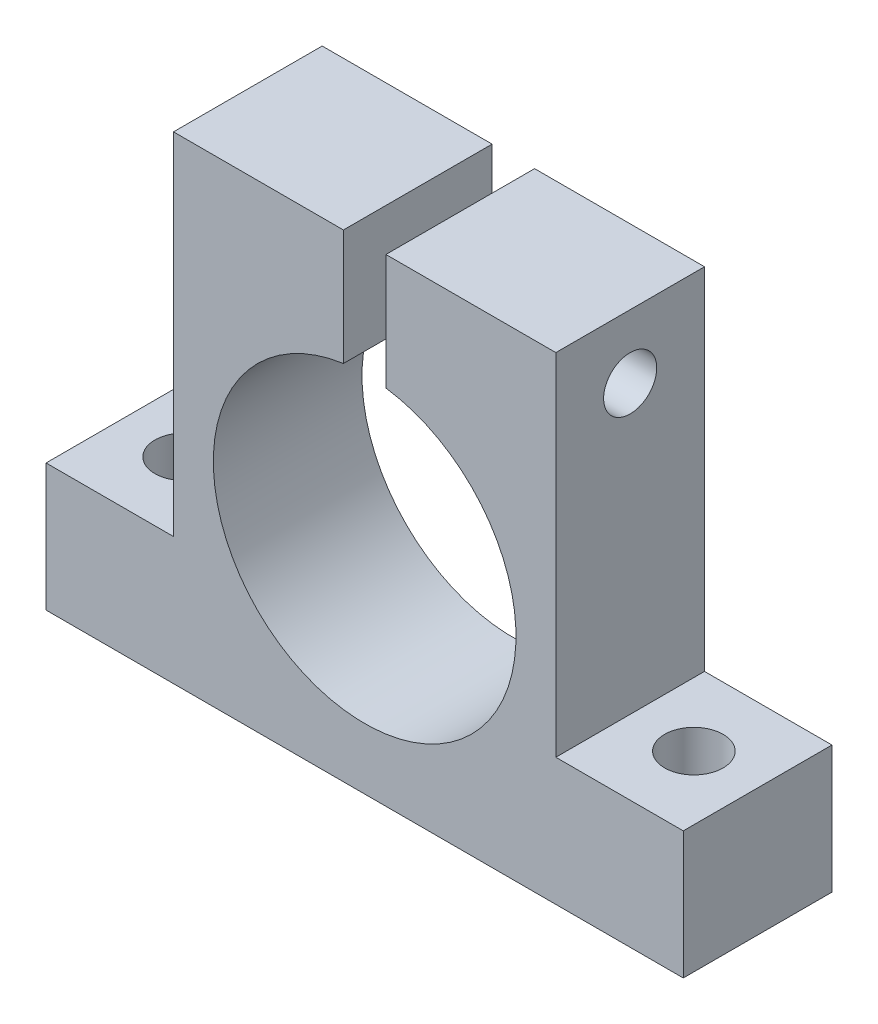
ISO-10303-21;
HEADER;
FILE_DESCRIPTION(('STEP AP214'),'2;1');
FILE_NAME('part.step','',(''),(''),'','','');
FILE_SCHEMA(('AUTOMOTIVE_DESIGN { 1 0 10303 214 1 1 1 1 }'));
ENDSEC;
DATA;
#1=APPLICATION_CONTEXT('core data for automotive mechanical design processes');
#2=APPLICATION_PROTOCOL_DEFINITION('international standard','automotive_design',2000,#1);
#3=PRODUCT_CONTEXT('',#1,'mechanical');
#4=PRODUCT('Part','Part','',(#3));
#5=PRODUCT_RELATED_PRODUCT_CATEGORY('part','',(#4));
#6=PRODUCT_DEFINITION_FORMATION('','',#4);
#7=PRODUCT_DEFINITION_CONTEXT('part definition',#1,'design');
#8=PRODUCT_DEFINITION('design','',#6,#7);
#9=PRODUCT_DEFINITION_SHAPE('','',#8);
#10=(LENGTH_UNIT() NAMED_UNIT(*) SI_UNIT(.MILLI.,.METRE.));
#11=(NAMED_UNIT(*) PLANE_ANGLE_UNIT() SI_UNIT($,.RADIAN.));
#12=(NAMED_UNIT(*) SI_UNIT($,.STERADIAN.) SOLID_ANGLE_UNIT());
#13=UNCERTAINTY_MEASURE_WITH_UNIT(LENGTH_MEASURE(1.E-05),#10,'distance_accuracy_value','');
#14=(GEOMETRIC_REPRESENTATION_CONTEXT(3) GLOBAL_UNCERTAINTY_ASSIGNED_CONTEXT((#13)) GLOBAL_UNIT_ASSIGNED_CONTEXT((#10,
#11,#12)) REPRESENTATION_CONTEXT('',''));
#15=CARTESIAN_POINT('',(0.,0.,0.));
#16=DIRECTION('',(0.,0.,1.));
#17=DIRECTION('',(1.,0.,0.));
#18=AXIS2_PLACEMENT_3D('',#15,#16,#17);
#19=CARTESIAN_POINT('',(-24.,-22.5,7.));
#20=DIRECTION('',(0.,1.,0.));
#21=DIRECTION('',(0.,0.,1.));
#22=AXIS2_PLACEMENT_3D('',#19,#20,#21);
#23=CYLINDRICAL_SURFACE('',#22,2.75);
#24=CARTESIAN_POINT('',(-24.,-22.5,7.));
#25=DIRECTION('',(0.,1.,0.));
#26=DIRECTION('',(0.,0.,1.));
#27=AXIS2_PLACEMENT_3D('',#24,#25,#26);
#28=CIRCLE('',#27,2.75);
#29=CARTESIAN_POINT('',(-24.,-22.5,9.75));
#30=VERTEX_POINT('',#29);
#31=EDGE_CURVE('E187',#30,#30,#28,.F.);
#32=ORIENTED_EDGE('',*,*,#31,.T.);
#33=EDGE_LOOP('',(#32));
#34=FACE_BOUND('',#33,.T.);
#35=CARTESIAN_POINT('',(-24.,-10.5,7.));
#36=DIRECTION('',(0.,1.,0.));
#37=DIRECTION('',(0.,0.,1.));
#38=AXIS2_PLACEMENT_3D('',#35,#36,#37);
#39=CIRCLE('',#38,2.75);
#40=CARTESIAN_POINT('',(-24.,-10.5,9.75));
#41=VERTEX_POINT('',#40);
#42=EDGE_CURVE('E223',#41,#41,#39,.T.);
#43=ORIENTED_EDGE('',*,*,#42,.T.);
#44=EDGE_LOOP('',(#43));
#45=FACE_BOUND('',#44,.T.);
#46=ADVANCED_FACE('F17',(#34,#45),#23,.F.);
#47=CARTESIAN_POINT('',(24.,-22.5,7.));
#48=DIRECTION('',(0.,1.,0.));
#49=DIRECTION('',(0.,0.,1.));
#50=AXIS2_PLACEMENT_3D('',#47,#48,#49);
#51=CYLINDRICAL_SURFACE('',#50,2.75);
#52=CARTESIAN_POINT('',(24.,-22.5,7.));
#53=DIRECTION('',(0.,1.,0.));
#54=DIRECTION('',(0.,0.,1.));
#55=AXIS2_PLACEMENT_3D('',#52,#53,#54);
#56=CIRCLE('',#55,2.75);
#57=CARTESIAN_POINT('',(24.,-22.5,9.75));
#58=VERTEX_POINT('',#57);
#59=EDGE_CURVE('E197',#58,#58,#56,.F.);
#60=ORIENTED_EDGE('',*,*,#59,.T.);
#61=EDGE_LOOP('',(#60));
#62=FACE_BOUND('',#61,.T.);
#63=CARTESIAN_POINT('',(24.,-10.5,7.));
#64=DIRECTION('',(0.,1.,0.));
#65=DIRECTION('',(0.,0.,1.));
#66=AXIS2_PLACEMENT_3D('',#63,#64,#65);
#67=CIRCLE('',#66,2.75);
#68=CARTESIAN_POINT('',(24.,-10.5,9.75));
#69=VERTEX_POINT('',#68);
#70=EDGE_CURVE('E242',#69,#69,#67,.T.);
#71=ORIENTED_EDGE('',*,*,#70,.T.);
#72=EDGE_LOOP('',(#71));
#73=FACE_BOUND('',#72,.T.);
#74=ADVANCED_FACE('F339',(#62,#73),#51,.F.);
#75=CARTESIAN_POINT('',(-5.07106781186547,16.5,7.));
#76=DIRECTION('',(1.,0.,0.));
#77=DIRECTION('',(0.,1.,0.));
#78=AXIS2_PLACEMENT_3D('',#75,#76,#77);
#79=CYLINDRICAL_SURFACE('',#78,2.5);
#80=CARTESIAN_POINT('',(18.,16.5,7.));
#81=DIRECTION('',(1.,0.,0.));
#82=DIRECTION('',(0.,1.,0.));
#83=AXIS2_PLACEMENT_3D('',#80,#81,#82);
#84=CIRCLE('',#83,2.5);
#85=CARTESIAN_POINT('',(18.,19.,7.));
#86=VERTEX_POINT('',#85);
#87=EDGE_CURVE('E165',#86,#86,#84,.T.);
#88=ORIENTED_EDGE('',*,*,#87,.T.);
#89=EDGE_LOOP('',(#88));
#90=FACE_BOUND('',#89,.T.);
#91=CARTESIAN_POINT('',(2.,16.5,7.));
#92=DIRECTION('',(1.,0.,0.));
#93=DIRECTION('',(0.,1.,0.));
#94=AXIS2_PLACEMENT_3D('',#91,#92,#93);
#95=CIRCLE('',#94,2.5);
#96=CARTESIAN_POINT('',(2.,19.,7.));
#97=VERTEX_POINT('',#96);
#98=EDGE_CURVE('E123',#97,#97,#95,.F.);
#99=ORIENTED_EDGE('',*,*,#98,.T.);
#100=EDGE_LOOP('',(#99));
#101=FACE_BOUND('',#100,.T.);
#102=ADVANCED_FACE('F342',(#90,#101),#79,.F.);
#103=CARTESIAN_POINT('',(-2.,16.5,7.));
#104=DIRECTION('',(1.,0.,0.));
#105=DIRECTION('',(0.,0.,-1.));
#106=AXIS2_PLACEMENT_3D('',#103,#104,#105);
#107=CYLINDRICAL_SURFACE('',#106,1.64999999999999);
#108=CARTESIAN_POINT('',(-18.,16.5,7.));
#109=DIRECTION('',(1.,0.,0.));
#110=DIRECTION('',(0.,0.,-1.));
#111=AXIS2_PLACEMENT_3D('',#108,#109,#110);
#112=CIRCLE('',#111,1.64999999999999);
#113=CARTESIAN_POINT('',(-18.,16.5,5.35000000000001));
#114=VERTEX_POINT('',#113);
#115=EDGE_CURVE('E20',#114,#114,#112,.F.);
#116=ORIENTED_EDGE('',*,*,#115,.T.);
#117=EDGE_LOOP('',(#116));
#118=FACE_BOUND('',#117,.T.);
#119=CARTESIAN_POINT('',(-2.,16.5,7.));
#120=DIRECTION('',(1.,0.,0.));
#121=DIRECTION('',(0.,0.,-1.));
#122=AXIS2_PLACEMENT_3D('',#119,#120,#121);
#123=CIRCLE('',#122,1.64999999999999);
#124=CARTESIAN_POINT('',(-2.,16.5,5.35000000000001));
#125=VERTEX_POINT('',#124);
#126=EDGE_CURVE('E113',#125,#125,#123,.T.);
#127=ORIENTED_EDGE('',*,*,#126,.T.);
#128=EDGE_LOOP('',(#127));
#129=FACE_BOUND('',#128,.T.);
#130=ADVANCED_FACE('F349',(#118,#129),#107,.F.);
#131=CARTESIAN_POINT('',(0.,0.,0.));
#132=DIRECTION('',(0.,0.,1.));
#133=DIRECTION('',(1.,0.,0.));
#134=AXIS2_PLACEMENT_3D('',#131,#132,#133);
#135=PLANE('',#134);
#136=DIRECTION('',(0.,1.,0.));
#137=VECTOR('',#136,1.);
#138=CARTESIAN_POINT('',(-18.,22.5,0.));
#139=LINE('',#138,#137);
#140=CARTESIAN_POINT('',(-18.,-10.5,0.));
#141=VERTEX_POINT('',#140);
#142=CARTESIAN_POINT('',(-18.,22.5,0.));
#143=VERTEX_POINT('',#142);
#144=EDGE_CURVE('E221',#141,#143,#139,.T.);
#145=ORIENTED_EDGE('',*,*,#144,.T.);
#146=DIRECTION('',(1.,0.,0.));
#147=VECTOR('',#146,1.);
#148=CARTESIAN_POINT('',(-30.,22.5,0.));
#149=LINE('',#148,#147);
#150=CARTESIAN_POINT('',(-2.,22.5,0.));
#151=VERTEX_POINT('',#150);
#152=EDGE_CURVE('E213',#143,#151,#149,.T.);
#153=ORIENTED_EDGE('',*,*,#152,.T.);
#154=DIRECTION('',(0.,-1.,0.));
#155=VECTOR('',#154,1.);
#156=CARTESIAN_POINT('',(-2.,22.5,0.));
#157=LINE('',#156,#155);
#158=CARTESIAN_POINT('',(-2.,11.6089510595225,0.));
#159=VERTEX_POINT('',#158);
#160=EDGE_CURVE('E111',#151,#159,#157,.T.);
#161=ORIENTED_EDGE('',*,*,#160,.T.);
#162=CARTESIAN_POINT('',(0.,-2.5,0.));
#163=DIRECTION('',(0.,0.,1.));
#164=DIRECTION('',(1.,0.,0.));
#165=AXIS2_PLACEMENT_3D('',#162,#163,#164);
#166=CIRCLE('',#165,14.25);
#167=CARTESIAN_POINT('',(2.,11.6089510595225,0.));
#168=VERTEX_POINT('',#167);
#169=EDGE_CURVE('E103',#159,#168,#166,.T.);
#170=ORIENTED_EDGE('',*,*,#169,.T.);
#171=DIRECTION('',(0.,1.,0.));
#172=VECTOR('',#171,1.);
#173=CARTESIAN_POINT('',(2.,22.5,0.));
#174=LINE('',#173,#172);
#175=CARTESIAN_POINT('',(2.,22.5,0.));
#176=VERTEX_POINT('',#175);
#177=EDGE_CURVE('E108',#168,#176,#174,.T.);
#178=ORIENTED_EDGE('',*,*,#177,.T.);
#179=DIRECTION('',(1.,0.,0.));
#180=VECTOR('',#179,1.);
#181=CARTESIAN_POINT('',(-30.,22.5,0.));
#182=LINE('',#181,#180);
#183=CARTESIAN_POINT('',(18.,22.5,0.));
#184=VERTEX_POINT('',#183);
#185=EDGE_CURVE('E145',#176,#184,#182,.T.);
#186=ORIENTED_EDGE('',*,*,#185,.T.);
#187=DIRECTION('',(0.,1.,0.));
#188=VECTOR('',#187,1.);
#189=CARTESIAN_POINT('',(18.,22.5,0.));
#190=LINE('',#189,#188);
#191=CARTESIAN_POINT('',(18.,-10.5,0.));
#192=VERTEX_POINT('',#191);
#193=EDGE_CURVE('E155',#184,#192,#190,.F.);
#194=ORIENTED_EDGE('',*,*,#193,.T.);
#195=DIRECTION('',(1.,0.,0.));
#196=VECTOR('',#195,1.);
#197=CARTESIAN_POINT('',(30.,-10.5,0.));
#198=LINE('',#197,#196);
#199=CARTESIAN_POINT('',(30.,-10.5,0.));
#200=VERTEX_POINT('',#199);
#201=EDGE_CURVE('E166',#192,#200,#198,.T.);
#202=ORIENTED_EDGE('',*,*,#201,.T.);
#203=DIRECTION('',(0.,-1.,0.));
#204=VECTOR('',#203,1.);
#205=CARTESIAN_POINT('',(30.,22.5,0.));
#206=LINE('',#205,#204);
#207=CARTESIAN_POINT('',(30.,-22.5,0.));
#208=VERTEX_POINT('',#207);
#209=EDGE_CURVE('E176',#200,#208,#206,.T.);
#210=ORIENTED_EDGE('',*,*,#209,.T.);
#211=DIRECTION('',(1.,0.,0.));
#212=VECTOR('',#211,1.);
#213=CARTESIAN_POINT('',(-30.,-22.5,0.));
#214=LINE('',#213,#212);
#215=CARTESIAN_POINT('',(-30.,-22.5,0.));
#216=VERTEX_POINT('',#215);
#217=EDGE_CURVE('E177',#208,#216,#214,.F.);
#218=ORIENTED_EDGE('',*,*,#217,.T.);
#219=DIRECTION('',(0.,1.,0.));
#220=VECTOR('',#219,1.);
#221=CARTESIAN_POINT('',(-30.,22.5,0.));
#222=LINE('',#221,#220);
#223=CARTESIAN_POINT('',(-30.,-10.5,0.));
#224=VERTEX_POINT('',#223);
#225=EDGE_CURVE('E198',#216,#224,#222,.T.);
#226=ORIENTED_EDGE('',*,*,#225,.T.);
#227=DIRECTION('',(1.,0.,0.));
#228=VECTOR('',#227,1.);
#229=CARTESIAN_POINT('',(-30.,-10.5,0.));
#230=LINE('',#229,#228);
#231=EDGE_CURVE('E208',#224,#141,#230,.T.);
#232=ORIENTED_EDGE('',*,*,#231,.T.);
#233=EDGE_LOOP('',(#145,#153,#161,#170,#178,#186,#194,#202,#210,#218,#226,#232));
#234=FACE_BOUND('',#233,.T.);
#235=ADVANCED_FACE('F107',(#234),#135,.F.);
#236=CARTESIAN_POINT('',(-18.,22.5,0.));
#237=DIRECTION('',(1.,0.,0.));
#238=DIRECTION('',(0.,0.,-1.));
#239=AXIS2_PLACEMENT_3D('',#236,#237,#238);
#240=PLANE('',#239);
#241=DIRECTION('',(0.,0.,-1.));
#242=VECTOR('',#241,1.);
#243=CARTESIAN_POINT('',(-18.,22.5,14.));
#244=LINE('',#243,#242);
#245=CARTESIAN_POINT('',(-18.,22.5,14.));
#246=VERTEX_POINT('',#245);
#247=EDGE_CURVE('E216',#246,#143,#244,.T.);
#248=ORIENTED_EDGE('',*,*,#247,.T.);
#249=ORIENTED_EDGE('',*,*,#144,.F.);
#250=DIRECTION('',(0.,0.,-1.));
#251=VECTOR('',#250,1.);
#252=CARTESIAN_POINT('',(-18.,-10.5,0.));
#253=LINE('',#252,#251);
#254=CARTESIAN_POINT('',(-18.,-10.5,14.));
#255=VERTEX_POINT('',#254);
#256=EDGE_CURVE('E206',#141,#255,#253,.F.);
#257=ORIENTED_EDGE('',*,*,#256,.T.);
#258=DIRECTION('',(0.,1.,0.));
#259=VECTOR('',#258,1.);
#260=CARTESIAN_POINT('',(-18.,0.,14.));
#261=LINE('',#260,#259);
#262=EDGE_CURVE('E203',#246,#255,#261,.F.);
#263=ORIENTED_EDGE('',*,*,#262,.F.);
#264=EDGE_LOOP('',(#248,#249,#257,#263));
#265=FACE_BOUND('',#264,.T.);
#266=ORIENTED_EDGE('',*,*,#115,.F.);
#267=EDGE_LOOP('',(#266));
#268=FACE_BOUND('',#267,.T.);
#269=ADVANCED_FACE('F278',(#265,#268),#240,.F.);
#270=CARTESIAN_POINT('',(-30.,-10.5,0.));
#271=DIRECTION('',(0.,-1.,0.));
#272=DIRECTION('',(0.,0.,-1.));
#273=AXIS2_PLACEMENT_3D('',#270,#271,#272);
#274=PLANE('',#273);
#275=ORIENTED_EDGE('',*,*,#256,.F.);
#276=ORIENTED_EDGE('',*,*,#231,.F.);
#277=DIRECTION('',(0.,0.,1.));
#278=VECTOR('',#277,1.);
#279=CARTESIAN_POINT('',(-30.,-10.5,14.));
#280=LINE('',#279,#278);
#281=CARTESIAN_POINT('',(-30.,-10.5,14.));
#282=VERTEX_POINT('',#281);
#283=EDGE_CURVE('E195',#224,#282,#280,.T.);
#284=ORIENTED_EDGE('',*,*,#283,.T.);
#285=DIRECTION('',(1.,0.,0.));
#286=VECTOR('',#285,1.);
#287=CARTESIAN_POINT('',(0.,-10.5,14.));
#288=LINE('',#287,#286);
#289=EDGE_CURVE('E192',#255,#282,#288,.F.);
#290=ORIENTED_EDGE('',*,*,#289,.F.);
#291=EDGE_LOOP('',(#275,#276,#284,#290));
#292=FACE_BOUND('',#291,.T.);
#293=ORIENTED_EDGE('',*,*,#42,.F.);
#294=EDGE_LOOP('',(#293));
#295=FACE_BOUND('',#294,.T.);
#296=ADVANCED_FACE('F275',(#292,#295),#274,.F.);
#297=CARTESIAN_POINT('',(-30.,22.5,14.));
#298=DIRECTION('',(1.,0.,0.));
#299=DIRECTION('',(0.,1.,0.));
#300=AXIS2_PLACEMENT_3D('',#297,#298,#299);
#301=PLANE('',#300);
#302=ORIENTED_EDGE('',*,*,#283,.F.);
#303=ORIENTED_EDGE('',*,*,#225,.F.);
#304=DIRECTION('',(0.,0.,1.));
#305=VECTOR('',#304,1.);
#306=CARTESIAN_POINT('',(-30.,-22.5,14.));
#307=LINE('',#306,#305);
#308=CARTESIAN_POINT('',(-30.,-22.5,14.));
#309=VERTEX_POINT('',#308);
#310=EDGE_CURVE('E185',#216,#309,#307,.T.);
#311=ORIENTED_EDGE('',*,*,#310,.T.);
#312=DIRECTION('',(0.,1.,0.));
#313=VECTOR('',#312,1.);
#314=CARTESIAN_POINT('',(-30.,0.,14.));
#315=LINE('',#314,#313);
#316=EDGE_CURVE('E182',#282,#309,#315,.F.);
#317=ORIENTED_EDGE('',*,*,#316,.F.);
#318=EDGE_LOOP('',(#302,#303,#311,#317));
#319=FACE_BOUND('',#318,.T.);
#320=ADVANCED_FACE('F277',(#319),#301,.F.);
#321=CARTESIAN_POINT('',(-30.,-22.5,14.));
#322=DIRECTION('',(0.,1.,0.));
#323=DIRECTION('',(0.,0.,1.));
#324=AXIS2_PLACEMENT_3D('',#321,#322,#323);
#325=PLANE('',#324);
#326=DIRECTION('',(0.,0.,1.));
#327=VECTOR('',#326,1.);
#328=CARTESIAN_POINT('',(30.,-22.5,14.));
#329=LINE('',#328,#327);
#330=CARTESIAN_POINT('',(30.,-22.5,14.));
#331=VERTEX_POINT('',#330);
#332=EDGE_CURVE('E174',#208,#331,#329,.T.);
#333=ORIENTED_EDGE('',*,*,#332,.T.);
#334=DIRECTION('',(1.,0.,0.));
#335=VECTOR('',#334,1.);
#336=CARTESIAN_POINT('',(0.,-22.5,14.));
#337=LINE('',#336,#335);
#338=EDGE_CURVE('E171',#309,#331,#337,.T.);
#339=ORIENTED_EDGE('',*,*,#338,.F.);
#340=ORIENTED_EDGE('',*,*,#310,.F.);
#341=ORIENTED_EDGE('',*,*,#217,.F.);
#342=EDGE_LOOP('',(#333,#339,#340,#341));
#343=FACE_BOUND('',#342,.T.);
#344=ORIENTED_EDGE('',*,*,#31,.F.);
#345=EDGE_LOOP('',(#344));
#346=FACE_BOUND('',#345,.T.);
#347=ORIENTED_EDGE('',*,*,#59,.F.);
#348=EDGE_LOOP('',(#347));
#349=FACE_BOUND('',#348,.T.);
#350=ADVANCED_FACE('F286',(#343,#346,#349),#325,.F.);
#351=CARTESIAN_POINT('',(30.,22.5,14.));
#352=DIRECTION('',(-1.,0.,0.));
#353=DIRECTION('',(0.,-1.,0.));
#354=AXIS2_PLACEMENT_3D('',#351,#352,#353);
#355=PLANE('',#354);
#356=DIRECTION('',(0.,0.,1.));
#357=VECTOR('',#356,1.);
#358=CARTESIAN_POINT('',(30.,-10.5,0.));
#359=LINE('',#358,#357);
#360=CARTESIAN_POINT('',(30.,-10.5,14.));
#361=VERTEX_POINT('',#360);
#362=EDGE_CURVE('E163',#200,#361,#359,.T.);
#363=ORIENTED_EDGE('',*,*,#362,.T.);
#364=DIRECTION('',(0.,1.,0.));
#365=VECTOR('',#364,1.);
#366=CARTESIAN_POINT('',(30.,0.,14.));
#367=LINE('',#366,#365);
#368=EDGE_CURVE('E160',#331,#361,#367,.T.);
#369=ORIENTED_EDGE('',*,*,#368,.F.);
#370=ORIENTED_EDGE('',*,*,#332,.F.);
#371=ORIENTED_EDGE('',*,*,#209,.F.);
#372=EDGE_LOOP('',(#363,#369,#370,#371));
#373=FACE_BOUND('',#372,.T.);
#374=ADVANCED_FACE('F322',(#373),#355,.F.);
#375=CARTESIAN_POINT('',(30.,-10.5,0.));
#376=DIRECTION('',(0.,-1.,0.));
#377=DIRECTION('',(1.,0.,0.));
#378=AXIS2_PLACEMENT_3D('',#375,#376,#377);
#379=PLANE('',#378);
#380=ORIENTED_EDGE('',*,*,#362,.F.);
#381=ORIENTED_EDGE('',*,*,#201,.F.);
#382=DIRECTION('',(0.,0.,1.));
#383=VECTOR('',#382,1.);
#384=CARTESIAN_POINT('',(18.,-10.5,0.));
#385=LINE('',#384,#383);
#386=CARTESIAN_POINT('',(18.,-10.5,14.));
#387=VERTEX_POINT('',#386);
#388=EDGE_CURVE('E153',#192,#387,#385,.T.);
#389=ORIENTED_EDGE('',*,*,#388,.T.);
#390=DIRECTION('',(1.,0.,0.));
#391=VECTOR('',#390,1.);
#392=CARTESIAN_POINT('',(0.,-10.5,14.));
#393=LINE('',#392,#391);
#394=EDGE_CURVE('E150',#361,#387,#393,.F.);
#395=ORIENTED_EDGE('',*,*,#394,.F.);
#396=EDGE_LOOP('',(#380,#381,#389,#395));
#397=FACE_BOUND('',#396,.T.);
#398=ORIENTED_EDGE('',*,*,#70,.F.);
#399=EDGE_LOOP('',(#398));
#400=FACE_BOUND('',#399,.T.);
#401=ADVANCED_FACE('F318',(#397,#400),#379,.F.);
#402=CARTESIAN_POINT('',(18.,22.5,0.));
#403=DIRECTION('',(-1.,0.,0.));
#404=DIRECTION('',(0.,0.,1.));
#405=AXIS2_PLACEMENT_3D('',#402,#403,#404);
#406=PLANE('',#405);
#407=ORIENTED_EDGE('',*,*,#388,.F.);
#408=ORIENTED_EDGE('',*,*,#193,.F.);
#409=DIRECTION('',(0.,0.,-1.));
#410=VECTOR('',#409,1.);
#411=CARTESIAN_POINT('',(18.,22.5,14.));
#412=LINE('',#411,#410);
#413=CARTESIAN_POINT('',(18.,22.5,14.));
#414=VERTEX_POINT('',#413);
#415=EDGE_CURVE('E143',#184,#414,#412,.F.);
#416=ORIENTED_EDGE('',*,*,#415,.T.);
#417=DIRECTION('',(0.,1.,0.));
#418=VECTOR('',#417,1.);
#419=CARTESIAN_POINT('',(18.,0.,14.));
#420=LINE('',#419,#418);
#421=EDGE_CURVE('E140',#387,#414,#420,.T.);
#422=ORIENTED_EDGE('',*,*,#421,.F.);
#423=EDGE_LOOP('',(#407,#408,#416,#422));
#424=FACE_BOUND('',#423,.T.);
#425=ORIENTED_EDGE('',*,*,#87,.F.);
#426=EDGE_LOOP('',(#425));
#427=FACE_BOUND('',#426,.T.);
#428=ADVANCED_FACE('F314',(#424,#427),#406,.F.);
#429=CARTESIAN_POINT('',(-30.,22.5,14.));
#430=DIRECTION('',(0.,-1.,0.));
#431=DIRECTION('',(0.,0.,-1.));
#432=AXIS2_PLACEMENT_3D('',#429,#430,#431);
#433=PLANE('',#432);
#434=ORIENTED_EDGE('',*,*,#415,.F.);
#435=ORIENTED_EDGE('',*,*,#185,.F.);
#436=DIRECTION('',(0.,0.,-1.));
#437=VECTOR('',#436,1.);
#438=CARTESIAN_POINT('',(2.,22.5,0.));
#439=LINE('',#438,#437);
#440=CARTESIAN_POINT('',(2.,22.5,14.));
#441=VERTEX_POINT('',#440);
#442=EDGE_CURVE('E122',#176,#441,#439,.F.);
#443=ORIENTED_EDGE('',*,*,#442,.T.);
#444=DIRECTION('',(1.,0.,0.));
#445=VECTOR('',#444,1.);
#446=CARTESIAN_POINT('',(0.,22.5,14.));
#447=LINE('',#446,#445);
#448=EDGE_CURVE('E136',#414,#441,#447,.F.);
#449=ORIENTED_EDGE('',*,*,#448,.F.);
#450=EDGE_LOOP('',(#434,#435,#443,#449));
#451=FACE_BOUND('',#450,.T.);
#452=ADVANCED_FACE('F311',(#451),#433,.F.);
#453=CARTESIAN_POINT('',(2.,22.5,0.));
#454=DIRECTION('',(1.,0.,0.));
#455=DIRECTION('',(0.,0.,-1.));
#456=AXIS2_PLACEMENT_3D('',#453,#454,#455);
#457=PLANE('',#456);
#458=ORIENTED_EDGE('',*,*,#442,.F.);
#459=ORIENTED_EDGE('',*,*,#177,.F.);
#460=DIRECTION('',(0.,0.,1.));
#461=VECTOR('',#460,1.);
#462=CARTESIAN_POINT('',(2.,11.6089510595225,0.));
#463=LINE('',#462,#461);
#464=CARTESIAN_POINT('',(2.,11.6089510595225,14.));
#465=VERTEX_POINT('',#464);
#466=EDGE_CURVE('E114',#168,#465,#463,.T.);
#467=ORIENTED_EDGE('',*,*,#466,.T.);
#468=DIRECTION('',(0.,1.,0.));
#469=VECTOR('',#468,1.);
#470=CARTESIAN_POINT('',(2.,0.,14.));
#471=LINE('',#470,#469);
#472=EDGE_CURVE('E139',#441,#465,#471,.F.);
#473=ORIENTED_EDGE('',*,*,#472,.F.);
#474=EDGE_LOOP('',(#458,#459,#467,#473));
#475=FACE_BOUND('',#474,.T.);
#476=ORIENTED_EDGE('',*,*,#98,.F.);
#477=EDGE_LOOP('',(#476));
#478=FACE_BOUND('',#477,.T.);
#479=ADVANCED_FACE('F118',(#475,#478),#457,.F.);
#480=CARTESIAN_POINT('',(0.,-2.5,0.));
#481=DIRECTION('',(0.,0.,1.));
#482=DIRECTION('',(1.,0.,0.));
#483=AXIS2_PLACEMENT_3D('',#480,#481,#482);
#484=CYLINDRICAL_SURFACE('',#483,14.25);
#485=ORIENTED_EDGE('',*,*,#169,.F.);
#486=DIRECTION('',(0.,0.,1.));
#487=VECTOR('',#486,1.);
#488=CARTESIAN_POINT('',(-2.,11.6089510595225,0.));
#489=LINE('',#488,#487);
#490=CARTESIAN_POINT('',(-2.,11.6089510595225,14.));
#491=VERTEX_POINT('',#490);
#492=EDGE_CURVE('E230',#159,#491,#489,.T.);
#493=ORIENTED_EDGE('',*,*,#492,.T.);
#494=CARTESIAN_POINT('',(0.,-2.5,14.));
#495=DIRECTION('',(0.,0.,1.));
#496=DIRECTION('',(1.,0.,0.));
#497=AXIS2_PLACEMENT_3D('',#494,#495,#496);
#498=CIRCLE('',#497,14.25);
#499=EDGE_CURVE('E126',#465,#491,#498,.F.);
#500=ORIENTED_EDGE('',*,*,#499,.F.);
#501=ORIENTED_EDGE('',*,*,#466,.F.);
#502=EDGE_LOOP('',(#485,#493,#500,#501));
#503=FACE_BOUND('',#502,.T.);
#504=ADVANCED_FACE('F125',(#503),#484,.F.);
#505=CARTESIAN_POINT('',(-2.,22.5,0.));
#506=DIRECTION('',(-1.,0.,0.));
#507=DIRECTION('',(0.,-1.,0.));
#508=AXIS2_PLACEMENT_3D('',#505,#506,#507);
#509=PLANE('',#508);
#510=DIRECTION('',(0.,0.,-1.));
#511=VECTOR('',#510,1.);
#512=CARTESIAN_POINT('',(-2.,22.5,14.));
#513=LINE('',#512,#511);
#514=CARTESIAN_POINT('',(-2.,22.5,14.));
#515=VERTEX_POINT('',#514);
#516=EDGE_CURVE('E35',#151,#515,#513,.F.);
#517=ORIENTED_EDGE('',*,*,#516,.T.);
#518=DIRECTION('',(0.,1.,0.));
#519=VECTOR('',#518,1.);
#520=CARTESIAN_POINT('',(-2.,0.,14.));
#521=LINE('',#520,#519);
#522=EDGE_CURVE('E26',#491,#515,#521,.T.);
#523=ORIENTED_EDGE('',*,*,#522,.F.);
#524=ORIENTED_EDGE('',*,*,#492,.F.);
#525=ORIENTED_EDGE('',*,*,#160,.F.);
#526=EDGE_LOOP('',(#517,#523,#524,#525));
#527=FACE_BOUND('',#526,.T.);
#528=ORIENTED_EDGE('',*,*,#126,.F.);
#529=EDGE_LOOP('',(#528));
#530=FACE_BOUND('',#529,.T.);
#531=ADVANCED_FACE('F300',(#527,#530),#509,.F.);
#532=CARTESIAN_POINT('',(-30.,22.5,14.));
#533=DIRECTION('',(0.,-1.,0.));
#534=DIRECTION('',(0.,0.,-1.));
#535=AXIS2_PLACEMENT_3D('',#532,#533,#534);
#536=PLANE('',#535);
#537=ORIENTED_EDGE('',*,*,#247,.F.);
#538=DIRECTION('',(1.,0.,0.));
#539=VECTOR('',#538,1.);
#540=CARTESIAN_POINT('',(0.,22.5,14.));
#541=LINE('',#540,#539);
#542=EDGE_CURVE('E11',#515,#246,#541,.F.);
#543=ORIENTED_EDGE('',*,*,#542,.F.);
#544=ORIENTED_EDGE('',*,*,#516,.F.);
#545=ORIENTED_EDGE('',*,*,#152,.F.);
#546=EDGE_LOOP('',(#537,#543,#544,#545));
#547=FACE_BOUND('',#546,.T.);
#548=ADVANCED_FACE('F294',(#547),#536,.F.);
#549=CARTESIAN_POINT('',(0.,0.,14.));
#550=DIRECTION('',(0.,0.,1.));
#551=DIRECTION('',(1.,0.,0.));
#552=AXIS2_PLACEMENT_3D('',#549,#550,#551);
#553=PLANE('',#552);
#554=ORIENTED_EDGE('',*,*,#522,.T.);
#555=ORIENTED_EDGE('',*,*,#542,.T.);
#556=ORIENTED_EDGE('',*,*,#262,.T.);
#557=ORIENTED_EDGE('',*,*,#289,.T.);
#558=ORIENTED_EDGE('',*,*,#316,.T.);
#559=ORIENTED_EDGE('',*,*,#338,.T.);
#560=ORIENTED_EDGE('',*,*,#368,.T.);
#561=ORIENTED_EDGE('',*,*,#394,.T.);
#562=ORIENTED_EDGE('',*,*,#421,.T.);
#563=ORIENTED_EDGE('',*,*,#448,.T.);
#564=ORIENTED_EDGE('',*,*,#472,.T.);
#565=ORIENTED_EDGE('',*,*,#499,.T.);
#566=EDGE_LOOP('',(#554,#555,#556,#557,#558,#559,#560,#561,#562,#563,#564,#565));
#567=FACE_BOUND('',#566,.T.);
#568=ADVANCED_FACE('F292',(#567),#553,.T.);
#569=CLOSED_SHELL('',(#46,#74,#102,#130,#235,#269,#296,#320,#350,#374,#401,#428,#452,#479,#504,
#531,#548,#568));
#570=MANIFOLD_SOLID_BREP('B1',#569);
#571=ADVANCED_BREP_SHAPE_REPRESENTATION('',(#18,#570),#14);
#572=SHAPE_DEFINITION_REPRESENTATION(#9,#571);
ENDSEC;
END-ISO-10303-21;
